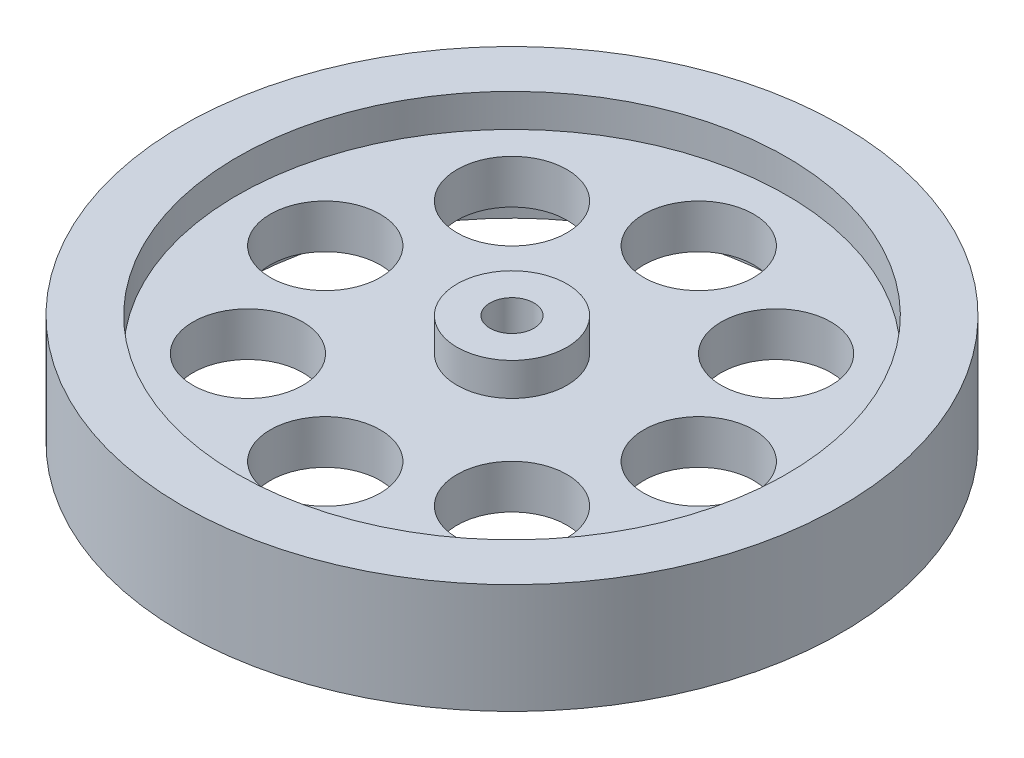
ISO-10303-21;
HEADER;
FILE_DESCRIPTION(('STEP AP214'),'2;1');
FILE_NAME('part.step','',(''),(''),'','','');
FILE_SCHEMA(('AUTOMOTIVE_DESIGN { 1 0 10303 214 1 1 1 1 }'));
ENDSEC;
DATA;
#1=APPLICATION_CONTEXT('core data for automotive mechanical design processes');
#2=APPLICATION_PROTOCOL_DEFINITION('international standard','automotive_design',2000,#1);
#3=PRODUCT_CONTEXT('',#1,'mechanical');
#4=PRODUCT('Part','Part','',(#3));
#5=PRODUCT_RELATED_PRODUCT_CATEGORY('part','',(#4));
#6=PRODUCT_DEFINITION_FORMATION('','',#4);
#7=PRODUCT_DEFINITION_CONTEXT('part definition',#1,'design');
#8=PRODUCT_DEFINITION('design','',#6,#7);
#9=PRODUCT_DEFINITION_SHAPE('','',#8);
#10=(LENGTH_UNIT() NAMED_UNIT(*) SI_UNIT(.MILLI.,.METRE.));
#11=(NAMED_UNIT(*) PLANE_ANGLE_UNIT() SI_UNIT($,.RADIAN.));
#12=(NAMED_UNIT(*) SI_UNIT($,.STERADIAN.) SOLID_ANGLE_UNIT());
#13=UNCERTAINTY_MEASURE_WITH_UNIT(LENGTH_MEASURE(1.E-05),#10,'distance_accuracy_value','');
#14=(GEOMETRIC_REPRESENTATION_CONTEXT(3) GLOBAL_UNCERTAINTY_ASSIGNED_CONTEXT((#13)) GLOBAL_UNIT_ASSIGNED_CONTEXT((#10,
#11,#12)) REPRESENTATION_CONTEXT('',''));
#15=CARTESIAN_POINT('',(0.,0.,0.));
#16=DIRECTION('',(0.,0.,1.));
#17=DIRECTION('',(1.,0.,0.));
#18=AXIS2_PLACEMENT_3D('',#15,#16,#17);
#19=CARTESIAN_POINT('',(0.,0.,0.));
#20=DIRECTION('',(0.,1.,0.));
#21=DIRECTION('',(0.,0.,1.));
#22=AXIS2_PLACEMENT_3D('',#19,#20,#21);
#23=CYLINDRICAL_SURFACE('',#22,5.);
#24=CARTESIAN_POINT('',(0.,0.,0.));
#25=DIRECTION('',(0.,1.,0.));
#26=DIRECTION('',(0.,0.,1.));
#27=AXIS2_PLACEMENT_3D('',#24,#25,#26);
#28=CIRCLE('',#27,5.);
#29=CARTESIAN_POINT('',(0.,0.,5.));
#30=VERTEX_POINT('',#29);
#31=EDGE_CURVE('E10',#30,#30,#28,.T.);
#32=ORIENTED_EDGE('',*,*,#31,.T.);
#33=EDGE_LOOP('',(#32));
#34=FACE_BOUND('',#33,.T.);
#35=CARTESIAN_POINT('',(0.,3.,0.));
#36=DIRECTION('',(0.,1.,0.));
#37=DIRECTION('',(0.,0.,1.));
#38=AXIS2_PLACEMENT_3D('',#35,#36,#37);
#39=CIRCLE('',#38,5.);
#40=CARTESIAN_POINT('',(0.,3.,5.));
#41=VERTEX_POINT('',#40);
#42=EDGE_CURVE('E82',#41,#41,#39,.T.);
#43=ORIENTED_EDGE('',*,*,#42,.F.);
#44=EDGE_LOOP('',(#43));
#45=FACE_BOUND('',#44,.T.);
#46=ADVANCED_FACE('F33',(#34,#45),#23,.T.);
#47=CARTESIAN_POINT('',(-5.,0.,0.));
#48=DIRECTION('',(0.,-1.,0.));
#49=DIRECTION('',(0.,0.,-1.));
#50=AXIS2_PLACEMENT_3D('',#47,#48,#49);
#51=PLANE('',#50);
#52=CARTESIAN_POINT('',(0.,0.,0.));
#53=DIRECTION('',(0.,1.,0.));
#54=DIRECTION('',(0.,0.,1.));
#55=AXIS2_PLACEMENT_3D('',#52,#53,#54);
#56=CIRCLE('',#55,3.00000000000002);
#57=CARTESIAN_POINT('',(0.,0.,3.00000000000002));
#58=VERTEX_POINT('',#57);
#59=EDGE_CURVE('E39',#58,#58,#56,.T.);
#60=ORIENTED_EDGE('',*,*,#59,.T.);
#61=EDGE_LOOP('',(#60));
#62=FACE_BOUND('',#61,.T.);
#63=ORIENTED_EDGE('',*,*,#31,.F.);
#64=EDGE_LOOP('',(#63));
#65=FACE_BOUND('',#64,.T.);
#66=ADVANCED_FACE('F218',(#62,#65),#51,.T.);
#67=CARTESIAN_POINT('',(0.,0.,0.));
#68=DIRECTION('',(0.,-1.,0.));
#69=DIRECTION('',(0.,0.,-1.));
#70=AXIS2_PLACEMENT_3D('',#67,#68,#69);
#71=CONICAL_SURFACE('',#70,3.00000000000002,0.78539816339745);
#72=CARTESIAN_POINT('',(0.,1.50000000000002,0.));
#73=DIRECTION('',(0.,1.,0.));
#74=DIRECTION('',(0.,0.,1.));
#75=AXIS2_PLACEMENT_3D('',#72,#73,#74);
#76=CIRCLE('',#75,1.5);
#77=CARTESIAN_POINT('',(0.,1.50000000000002,1.5));
#78=VERTEX_POINT('',#77);
#79=EDGE_CURVE('E43',#78,#78,#76,.T.);
#80=ORIENTED_EDGE('',*,*,#79,.T.);
#81=EDGE_LOOP('',(#80));
#82=FACE_BOUND('',#81,.T.);
#83=ORIENTED_EDGE('',*,*,#59,.F.);
#84=EDGE_LOOP('',(#83));
#85=FACE_BOUND('',#84,.T.);
#86=ADVANCED_FACE('F212',(#82,#85),#71,.F.);
#87=CARTESIAN_POINT('',(0.,0.,0.));
#88=DIRECTION('',(0.,1.,0.));
#89=DIRECTION('',(0.,0.,1.));
#90=AXIS2_PLACEMENT_3D('',#87,#88,#89);
#91=CYLINDRICAL_SURFACE('',#90,1.5);
#92=CARTESIAN_POINT('',(0.,4.00000000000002,0.));
#93=DIRECTION('',(0.,1.,0.));
#94=DIRECTION('',(0.,0.,1.));
#95=AXIS2_PLACEMENT_3D('',#92,#93,#94);
#96=CIRCLE('',#95,1.5);
#97=CARTESIAN_POINT('',(0.,4.00000000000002,1.5));
#98=VERTEX_POINT('',#97);
#99=EDGE_CURVE('E47',#98,#98,#96,.T.);
#100=ORIENTED_EDGE('',*,*,#99,.T.);
#101=EDGE_LOOP('',(#100));
#102=FACE_BOUND('',#101,.T.);
#103=ORIENTED_EDGE('',*,*,#79,.F.);
#104=EDGE_LOOP('',(#103));
#105=FACE_BOUND('',#104,.T.);
#106=ADVANCED_FACE('F206',(#102,#105),#91,.F.);
#107=CARTESIAN_POINT('',(-2.,4.00000000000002,0.));
#108=DIRECTION('',(0.,1.,0.));
#109=DIRECTION('',(0.,0.,1.));
#110=AXIS2_PLACEMENT_3D('',#107,#108,#109);
#111=PLANE('',#110);
#112=CARTESIAN_POINT('',(0.,4.00000000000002,0.));
#113=DIRECTION('',(0.,1.,0.));
#114=DIRECTION('',(0.,0.,1.));
#115=AXIS2_PLACEMENT_3D('',#112,#113,#114);
#116=CIRCLE('',#115,2.);
#117=CARTESIAN_POINT('',(0.,4.00000000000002,2.));
#118=VERTEX_POINT('',#117);
#119=EDGE_CURVE('E52',#118,#118,#116,.T.);
#120=ORIENTED_EDGE('',*,*,#119,.T.);
#121=EDGE_LOOP('',(#120));
#122=FACE_BOUND('',#121,.T.);
#123=ORIENTED_EDGE('',*,*,#99,.F.);
#124=EDGE_LOOP('',(#123));
#125=FACE_BOUND('',#124,.T.);
#126=ADVANCED_FACE('F200',(#122,#125),#111,.T.);
#127=CARTESIAN_POINT('',(0.,0.,0.));
#128=DIRECTION('',(0.,1.,0.));
#129=DIRECTION('',(0.,0.,1.));
#130=AXIS2_PLACEMENT_3D('',#127,#128,#129);
#131=CYLINDRICAL_SURFACE('',#130,2.);
#132=CARTESIAN_POINT('',(0.,10.,0.));
#133=DIRECTION('',(0.,1.,0.));
#134=DIRECTION('',(0.,0.,1.));
#135=AXIS2_PLACEMENT_3D('',#132,#133,#134);
#136=CIRCLE('',#135,2.);
#137=CARTESIAN_POINT('',(0.,10.,2.));
#138=VERTEX_POINT('',#137);
#139=EDGE_CURVE('E55',#138,#138,#136,.T.);
#140=ORIENTED_EDGE('',*,*,#139,.T.);
#141=EDGE_LOOP('',(#140));
#142=FACE_BOUND('',#141,.T.);
#143=ORIENTED_EDGE('',*,*,#119,.F.);
#144=EDGE_LOOP('',(#143));
#145=FACE_BOUND('',#144,.T.);
#146=ADVANCED_FACE('F194',(#142,#145),#131,.F.);
#147=CARTESIAN_POINT('',(-2.,10.,0.));
#148=DIRECTION('',(0.,1.,0.));
#149=DIRECTION('',(0.,0.,1.));
#150=AXIS2_PLACEMENT_3D('',#147,#148,#149);
#151=PLANE('',#150);
#152=CARTESIAN_POINT('',(0.,10.,0.));
#153=DIRECTION('',(0.,1.,0.));
#154=DIRECTION('',(0.,0.,1.));
#155=AXIS2_PLACEMENT_3D('',#152,#153,#154);
#156=CIRCLE('',#155,5.);
#157=CARTESIAN_POINT('',(0.,10.,5.));
#158=VERTEX_POINT('',#157);
#159=EDGE_CURVE('E58',#158,#158,#156,.T.);
#160=ORIENTED_EDGE('',*,*,#159,.T.);
#161=EDGE_LOOP('',(#160));
#162=FACE_BOUND('',#161,.T.);
#163=ORIENTED_EDGE('',*,*,#139,.F.);
#164=EDGE_LOOP('',(#163));
#165=FACE_BOUND('',#164,.T.);
#166=ADVANCED_FACE('F188',(#162,#165),#151,.T.);
#167=CARTESIAN_POINT('',(0.,0.,0.));
#168=DIRECTION('',(0.,1.,0.));
#169=DIRECTION('',(0.,0.,1.));
#170=AXIS2_PLACEMENT_3D('',#167,#168,#169);
#171=CYLINDRICAL_SURFACE('',#170,5.);
#172=CARTESIAN_POINT('',(0.,7.,0.));
#173=DIRECTION('',(0.,1.,0.));
#174=DIRECTION('',(0.,0.,1.));
#175=AXIS2_PLACEMENT_3D('',#172,#173,#174);
#176=CIRCLE('',#175,5.);
#177=CARTESIAN_POINT('',(0.,7.,5.));
#178=VERTEX_POINT('',#177);
#179=EDGE_CURVE('E61',#178,#178,#176,.T.);
#180=ORIENTED_EDGE('',*,*,#179,.T.);
#181=EDGE_LOOP('',(#180));
#182=FACE_BOUND('',#181,.T.);
#183=ORIENTED_EDGE('',*,*,#159,.F.);
#184=EDGE_LOOP('',(#183));
#185=FACE_BOUND('',#184,.T.);
#186=ADVANCED_FACE('F181',(#182,#185),#171,.T.);
#187=CARTESIAN_POINT('',(-5.,7.,0.));
#188=DIRECTION('',(0.,1.,0.));
#189=DIRECTION('',(0.,0.,1.));
#190=AXIS2_PLACEMENT_3D('',#187,#188,#189);
#191=PLANE('',#190);
#192=CARTESIAN_POINT('',(-12.0208152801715,7.,-12.0208152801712));
#193=DIRECTION('',(0.,1.,0.));
#194=DIRECTION('',(0.,0.,1.));
#195=AXIS2_PLACEMENT_3D('',#192,#193,#194);
#196=CIRCLE('',#195,5.);
#197=CARTESIAN_POINT('',(-12.0208152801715,7.,-7.02081528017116));
#198=VERTEX_POINT('',#197);
#199=EDGE_CURVE('E85',#198,#198,#196,.T.);
#200=ORIENTED_EDGE('',*,*,#199,.F.);
#201=EDGE_LOOP('',(#200));
#202=FACE_BOUND('',#201,.T.);
#203=CARTESIAN_POINT('',(-1.78065548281E-13,7.,-17.));
#204=DIRECTION('',(0.,1.,0.));
#205=DIRECTION('',(0.,0.,1.));
#206=AXIS2_PLACEMENT_3D('',#203,#204,#205);
#207=CIRCLE('',#206,5.);
#208=CARTESIAN_POINT('',(-1.78065548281E-13,7.,-12.));
#209=VERTEX_POINT('',#208);
#210=EDGE_CURVE('E88',#209,#209,#207,.T.);
#211=ORIENTED_EDGE('',*,*,#210,.F.);
#212=EDGE_LOOP('',(#211));
#213=FACE_BOUND('',#212,.T.);
#214=CARTESIAN_POINT('',(12.0208152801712,7.,-12.0208152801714));
#215=DIRECTION('',(0.,1.,0.));
#216=DIRECTION('',(0.,0.,1.));
#217=AXIS2_PLACEMENT_3D('',#214,#215,#216);
#218=CIRCLE('',#217,5.);
#219=CARTESIAN_POINT('',(12.0208152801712,7.,-7.02081528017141));
#220=VERTEX_POINT('',#219);
#221=EDGE_CURVE('E91',#220,#220,#218,.T.);
#222=ORIENTED_EDGE('',*,*,#221,.F.);
#223=EDGE_LOOP('',(#222));
#224=FACE_BOUND('',#223,.T.);
#225=CARTESIAN_POINT('',(17.,7.,-1.18710365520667E-13));
#226=DIRECTION('',(0.,1.,0.));
#227=DIRECTION('',(0.,0.,1.));
#228=AXIS2_PLACEMENT_3D('',#225,#226,#227);
#229=CIRCLE('',#228,5.);
#230=CARTESIAN_POINT('',(17.,7.,4.99999999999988));
#231=VERTEX_POINT('',#230);
#232=EDGE_CURVE('E94',#231,#231,#229,.T.);
#233=ORIENTED_EDGE('',*,*,#232,.F.);
#234=EDGE_LOOP('',(#233));
#235=FACE_BOUND('',#234,.T.);
#236=CARTESIAN_POINT('',(12.0208152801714,7.,12.0208152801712));
#237=DIRECTION('',(0.,1.,0.));
#238=DIRECTION('',(0.,0.,1.));
#239=AXIS2_PLACEMENT_3D('',#236,#237,#238);
#240=CIRCLE('',#239,5.);
#241=CARTESIAN_POINT('',(12.0208152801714,7.,17.0208152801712));
#242=VERTEX_POINT('',#241);
#243=EDGE_CURVE('E97',#242,#242,#240,.T.);
#244=ORIENTED_EDGE('',*,*,#243,.F.);
#245=EDGE_LOOP('',(#244));
#246=FACE_BOUND('',#245,.T.);
#247=CARTESIAN_POINT('',(0.,7.,17.));
#248=DIRECTION('',(0.,1.,0.));
#249=DIRECTION('',(0.,0.,1.));
#250=AXIS2_PLACEMENT_3D('',#247,#248,#249);
#251=CIRCLE('',#250,5.);
#252=CARTESIAN_POINT('',(0.,7.,22.));
#253=VERTEX_POINT('',#252);
#254=EDGE_CURVE('E100',#253,#253,#251,.T.);
#255=ORIENTED_EDGE('',*,*,#254,.F.);
#256=EDGE_LOOP('',(#255));
#257=FACE_BOUND('',#256,.T.);
#258=CARTESIAN_POINT('',(-12.0208152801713,7.,12.0208152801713));
#259=DIRECTION('',(0.,1.,0.));
#260=DIRECTION('',(0.,0.,1.));
#261=AXIS2_PLACEMENT_3D('',#258,#259,#260);
#262=CIRCLE('',#261,5.);
#263=CARTESIAN_POINT('',(-12.0208152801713,7.,17.0208152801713));
#264=VERTEX_POINT('',#263);
#265=EDGE_CURVE('E103',#264,#264,#262,.T.);
#266=ORIENTED_EDGE('',*,*,#265,.F.);
#267=EDGE_LOOP('',(#266));
#268=FACE_BOUND('',#267,.T.);
#269=CARTESIAN_POINT('',(-17.,7.,0.));
#270=DIRECTION('',(0.,1.,0.));
#271=DIRECTION('',(0.,0.,1.));
#272=AXIS2_PLACEMENT_3D('',#269,#270,#271);
#273=CIRCLE('',#272,5.);
#274=CARTESIAN_POINT('',(-17.,7.,5.));
#275=VERTEX_POINT('',#274);
#276=EDGE_CURVE('E106',#275,#275,#273,.T.);
#277=ORIENTED_EDGE('',*,*,#276,.F.);
#278=EDGE_LOOP('',(#277));
#279=FACE_BOUND('',#278,.T.);
#280=CARTESIAN_POINT('',(0.,7.,0.));
#281=DIRECTION('',(0.,1.,0.));
#282=DIRECTION('',(0.,0.,1.));
#283=AXIS2_PLACEMENT_3D('',#280,#281,#282);
#284=CIRCLE('',#283,25.);
#285=CARTESIAN_POINT('',(0.,7.,25.));
#286=VERTEX_POINT('',#285);
#287=EDGE_CURVE('E64',#286,#286,#284,.T.);
#288=ORIENTED_EDGE('',*,*,#287,.T.);
#289=EDGE_LOOP('',(#288));
#290=FACE_BOUND('',#289,.T.);
#291=ORIENTED_EDGE('',*,*,#179,.F.);
#292=EDGE_LOOP('',(#291));
#293=FACE_BOUND('',#292,.T.);
#294=ADVANCED_FACE('F175',(#202,#213,#224,#235,#246,#257,#268,#279,#290,#293),#191,.T.);
#295=CARTESIAN_POINT('',(0.,0.,0.));
#296=DIRECTION('',(0.,1.,0.));
#297=DIRECTION('',(0.,0.,1.));
#298=AXIS2_PLACEMENT_3D('',#295,#296,#297);
#299=CYLINDRICAL_SURFACE('',#298,25.);
#300=CARTESIAN_POINT('',(0.,10.,0.));
#301=DIRECTION('',(0.,1.,0.));
#302=DIRECTION('',(0.,0.,1.));
#303=AXIS2_PLACEMENT_3D('',#300,#301,#302);
#304=CIRCLE('',#303,25.);
#305=CARTESIAN_POINT('',(0.,10.,25.));
#306=VERTEX_POINT('',#305);
#307=EDGE_CURVE('E67',#306,#306,#304,.T.);
#308=ORIENTED_EDGE('',*,*,#307,.T.);
#309=EDGE_LOOP('',(#308));
#310=FACE_BOUND('',#309,.T.);
#311=ORIENTED_EDGE('',*,*,#287,.F.);
#312=EDGE_LOOP('',(#311));
#313=FACE_BOUND('',#312,.T.);
#314=ADVANCED_FACE('F169',(#310,#313),#299,.F.);
#315=CARTESIAN_POINT('',(-25.,10.,0.));
#316=DIRECTION('',(0.,1.,0.));
#317=DIRECTION('',(0.,0.,1.));
#318=AXIS2_PLACEMENT_3D('',#315,#316,#317);
#319=PLANE('',#318);
#320=CARTESIAN_POINT('',(0.,10.,0.));
#321=DIRECTION('',(0.,1.,0.));
#322=DIRECTION('',(0.,0.,1.));
#323=AXIS2_PLACEMENT_3D('',#320,#321,#322);
#324=CIRCLE('',#323,30.);
#325=CARTESIAN_POINT('',(0.,10.,30.));
#326=VERTEX_POINT('',#325);
#327=EDGE_CURVE('E70',#326,#326,#324,.T.);
#328=ORIENTED_EDGE('',*,*,#327,.T.);
#329=EDGE_LOOP('',(#328));
#330=FACE_BOUND('',#329,.T.);
#331=ORIENTED_EDGE('',*,*,#307,.F.);
#332=EDGE_LOOP('',(#331));
#333=FACE_BOUND('',#332,.T.);
#334=ADVANCED_FACE('F163',(#330,#333),#319,.T.);
#335=CARTESIAN_POINT('',(0.,0.,0.));
#336=DIRECTION('',(0.,1.,0.));
#337=DIRECTION('',(0.,0.,1.));
#338=AXIS2_PLACEMENT_3D('',#335,#336,#337);
#339=CYLINDRICAL_SURFACE('',#338,30.);
#340=CARTESIAN_POINT('',(0.,0.,0.));
#341=DIRECTION('',(0.,1.,0.));
#342=DIRECTION('',(0.,0.,1.));
#343=AXIS2_PLACEMENT_3D('',#340,#341,#342);
#344=CIRCLE('',#343,30.);
#345=CARTESIAN_POINT('',(0.,0.,30.));
#346=VERTEX_POINT('',#345);
#347=EDGE_CURVE('E73',#346,#346,#344,.T.);
#348=ORIENTED_EDGE('',*,*,#347,.T.);
#349=EDGE_LOOP('',(#348));
#350=FACE_BOUND('',#349,.T.);
#351=ORIENTED_EDGE('',*,*,#327,.F.);
#352=EDGE_LOOP('',(#351));
#353=FACE_BOUND('',#352,.T.);
#354=ADVANCED_FACE('F157',(#350,#353),#339,.T.);
#355=CARTESIAN_POINT('',(-30.,0.,0.));
#356=DIRECTION('',(0.,-1.,0.));
#357=DIRECTION('',(0.,0.,-1.));
#358=AXIS2_PLACEMENT_3D('',#355,#356,#357);
#359=PLANE('',#358);
#360=CARTESIAN_POINT('',(0.,0.,0.));
#361=DIRECTION('',(0.,1.,0.));
#362=DIRECTION('',(0.,0.,1.));
#363=AXIS2_PLACEMENT_3D('',#360,#361,#362);
#364=CIRCLE('',#363,25.);
#365=CARTESIAN_POINT('',(0.,0.,25.));
#366=VERTEX_POINT('',#365);
#367=EDGE_CURVE('E76',#366,#366,#364,.T.);
#368=ORIENTED_EDGE('',*,*,#367,.T.);
#369=EDGE_LOOP('',(#368));
#370=FACE_BOUND('',#369,.T.);
#371=ORIENTED_EDGE('',*,*,#347,.F.);
#372=EDGE_LOOP('',(#371));
#373=FACE_BOUND('',#372,.T.);
#374=ADVANCED_FACE('F151',(#370,#373),#359,.T.);
#375=CARTESIAN_POINT('',(0.,0.,0.));
#376=DIRECTION('',(0.,1.,0.));
#377=DIRECTION('',(0.,0.,1.));
#378=AXIS2_PLACEMENT_3D('',#375,#376,#377);
#379=CYLINDRICAL_SURFACE('',#378,25.);
#380=CARTESIAN_POINT('',(0.,3.,0.));
#381=DIRECTION('',(0.,1.,0.));
#382=DIRECTION('',(0.,0.,1.));
#383=AXIS2_PLACEMENT_3D('',#380,#381,#382);
#384=CIRCLE('',#383,25.);
#385=CARTESIAN_POINT('',(0.,3.,25.));
#386=VERTEX_POINT('',#385);
#387=EDGE_CURVE('E79',#386,#386,#384,.T.);
#388=ORIENTED_EDGE('',*,*,#387,.T.);
#389=EDGE_LOOP('',(#388));
#390=FACE_BOUND('',#389,.T.);
#391=ORIENTED_EDGE('',*,*,#367,.F.);
#392=EDGE_LOOP('',(#391));
#393=FACE_BOUND('',#392,.T.);
#394=ADVANCED_FACE('F140',(#390,#393),#379,.F.);
#395=CARTESIAN_POINT('',(-25.,3.,0.));
#396=DIRECTION('',(0.,-1.,0.));
#397=DIRECTION('',(0.,0.,-1.));
#398=AXIS2_PLACEMENT_3D('',#395,#396,#397);
#399=PLANE('',#398);
#400=CARTESIAN_POINT('',(-12.0208152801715,3.,-12.0208152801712));
#401=DIRECTION('',(0.,-1.,0.));
#402=DIRECTION('',(0.,0.,-1.));
#403=AXIS2_PLACEMENT_3D('',#400,#401,#402);
#404=CIRCLE('',#403,5.);
#405=CARTESIAN_POINT('',(-12.0208152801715,3.,-17.0208152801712));
#406=VERTEX_POINT('',#405);
#407=EDGE_CURVE('E113',#406,#406,#404,.T.);
#408=ORIENTED_EDGE('',*,*,#407,.F.);
#409=EDGE_LOOP('',(#408));
#410=FACE_BOUND('',#409,.T.);
#411=CARTESIAN_POINT('',(-1.78065548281E-13,3.,-17.));
#412=DIRECTION('',(0.,-1.,0.));
#413=DIRECTION('',(0.,0.,-1.));
#414=AXIS2_PLACEMENT_3D('',#411,#412,#413);
#415=CIRCLE('',#414,5.);
#416=CARTESIAN_POINT('',(-1.78065548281E-13,3.,-22.));
#417=VERTEX_POINT('',#416);
#418=EDGE_CURVE('E116',#417,#417,#415,.T.);
#419=ORIENTED_EDGE('',*,*,#418,.F.);
#420=EDGE_LOOP('',(#419));
#421=FACE_BOUND('',#420,.T.);
#422=CARTESIAN_POINT('',(12.0208152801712,3.,-12.0208152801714));
#423=DIRECTION('',(0.,-1.,0.));
#424=DIRECTION('',(0.,0.,-1.));
#425=AXIS2_PLACEMENT_3D('',#422,#423,#424);
#426=CIRCLE('',#425,5.);
#427=CARTESIAN_POINT('',(12.0208152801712,3.,-17.0208152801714));
#428=VERTEX_POINT('',#427);
#429=EDGE_CURVE('E119',#428,#428,#426,.T.);
#430=ORIENTED_EDGE('',*,*,#429,.F.);
#431=EDGE_LOOP('',(#430));
#432=FACE_BOUND('',#431,.T.);
#433=CARTESIAN_POINT('',(17.,3.,-1.18710365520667E-13));
#434=DIRECTION('',(0.,-1.,0.));
#435=DIRECTION('',(0.,0.,-1.));
#436=AXIS2_PLACEMENT_3D('',#433,#434,#435);
#437=CIRCLE('',#436,5.);
#438=CARTESIAN_POINT('',(17.,3.,-5.00000000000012));
#439=VERTEX_POINT('',#438);
#440=EDGE_CURVE('E122',#439,#439,#437,.T.);
#441=ORIENTED_EDGE('',*,*,#440,.F.);
#442=EDGE_LOOP('',(#441));
#443=FACE_BOUND('',#442,.T.);
#444=CARTESIAN_POINT('',(12.0208152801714,3.,12.0208152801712));
#445=DIRECTION('',(0.,-1.,0.));
#446=DIRECTION('',(0.,0.,-1.));
#447=AXIS2_PLACEMENT_3D('',#444,#445,#446);
#448=CIRCLE('',#447,5.);
#449=CARTESIAN_POINT('',(12.0208152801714,3.,7.02081528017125));
#450=VERTEX_POINT('',#449);
#451=EDGE_CURVE('E125',#450,#450,#448,.T.);
#452=ORIENTED_EDGE('',*,*,#451,.F.);
#453=EDGE_LOOP('',(#452));
#454=FACE_BOUND('',#453,.T.);
#455=CARTESIAN_POINT('',(0.,3.,17.));
#456=DIRECTION('',(0.,-1.,0.));
#457=DIRECTION('',(0.,0.,-1.));
#458=AXIS2_PLACEMENT_3D('',#455,#456,#457);
#459=CIRCLE('',#458,5.);
#460=CARTESIAN_POINT('',(0.,3.,12.));
#461=VERTEX_POINT('',#460);
#462=EDGE_CURVE('E128',#461,#461,#459,.T.);
#463=ORIENTED_EDGE('',*,*,#462,.F.);
#464=EDGE_LOOP('',(#463));
#465=FACE_BOUND('',#464,.T.);
#466=CARTESIAN_POINT('',(-12.0208152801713,3.,12.0208152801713));
#467=DIRECTION('',(0.,-1.,0.));
#468=DIRECTION('',(0.,0.,-1.));
#469=AXIS2_PLACEMENT_3D('',#466,#467,#468);
#470=CIRCLE('',#469,5.);
#471=CARTESIAN_POINT('',(-12.0208152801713,3.,7.02081528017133));
#472=VERTEX_POINT('',#471);
#473=EDGE_CURVE('E112',#472,#472,#470,.T.);
#474=ORIENTED_EDGE('',*,*,#473,.F.);
#475=EDGE_LOOP('',(#474));
#476=FACE_BOUND('',#475,.T.);
#477=CARTESIAN_POINT('',(-17.,3.,0.));
#478=DIRECTION('',(0.,-1.,0.));
#479=DIRECTION('',(0.,0.,-1.));
#480=AXIS2_PLACEMENT_3D('',#477,#478,#479);
#481=CIRCLE('',#480,5.);
#482=CARTESIAN_POINT('',(-17.,3.,-5.));
#483=VERTEX_POINT('',#482);
#484=EDGE_CURVE('E109',#483,#483,#481,.T.);
#485=ORIENTED_EDGE('',*,*,#484,.F.);
#486=EDGE_LOOP('',(#485));
#487=FACE_BOUND('',#486,.T.);
#488=ORIENTED_EDGE('',*,*,#42,.T.);
#489=EDGE_LOOP('',(#488));
#490=FACE_BOUND('',#489,.T.);
#491=ORIENTED_EDGE('',*,*,#387,.F.);
#492=EDGE_LOOP('',(#491));
#493=FACE_BOUND('',#492,.T.);
#494=ADVANCED_FACE('F136',(#410,#421,#432,#443,#454,#465,#476,#487,#490,#493),#399,.T.);
#495=CARTESIAN_POINT('',(-17.,10.,0.));
#496=DIRECTION('',(0.,-1.,0.));
#497=DIRECTION('',(0.,0.,-1.));
#498=AXIS2_PLACEMENT_3D('',#495,#496,#497);
#499=CYLINDRICAL_SURFACE('',#498,5.);
#500=ORIENTED_EDGE('',*,*,#276,.T.);
#501=EDGE_LOOP('',(#500));
#502=FACE_BOUND('',#501,.T.);
#503=ORIENTED_EDGE('',*,*,#484,.T.);
#504=EDGE_LOOP('',(#503));
#505=FACE_BOUND('',#504,.T.);
#506=ADVANCED_FACE('F139',(#502,#505),#499,.F.);
#507=CARTESIAN_POINT('',(-12.0208152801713,10.,12.0208152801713));
#508=DIRECTION('',(0.,-1.,0.));
#509=DIRECTION('',(0.,0.,-1.));
#510=AXIS2_PLACEMENT_3D('',#507,#508,#509);
#511=CYLINDRICAL_SURFACE('',#510,5.);
#512=ORIENTED_EDGE('',*,*,#265,.T.);
#513=EDGE_LOOP('',(#512));
#514=FACE_BOUND('',#513,.T.);
#515=ORIENTED_EDGE('',*,*,#473,.T.);
#516=EDGE_LOOP('',(#515));
#517=FACE_BOUND('',#516,.T.);
#518=ADVANCED_FACE('F134',(#514,#517),#511,.F.);
#519=CARTESIAN_POINT('',(0.,10.,17.));
#520=DIRECTION('',(0.,-1.,0.));
#521=DIRECTION('',(0.,0.,-1.));
#522=AXIS2_PLACEMENT_3D('',#519,#520,#521);
#523=CYLINDRICAL_SURFACE('',#522,5.);
#524=ORIENTED_EDGE('',*,*,#254,.T.);
#525=EDGE_LOOP('',(#524));
#526=FACE_BOUND('',#525,.T.);
#527=ORIENTED_EDGE('',*,*,#462,.T.);
#528=EDGE_LOOP('',(#527));
#529=FACE_BOUND('',#528,.T.);
#530=ADVANCED_FACE('F304',(#526,#529),#523,.F.);
#531=CARTESIAN_POINT('',(12.0208152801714,10.,12.0208152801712));
#532=DIRECTION('',(0.,-1.,0.));
#533=DIRECTION('',(0.,0.,-1.));
#534=AXIS2_PLACEMENT_3D('',#531,#532,#533);
#535=CYLINDRICAL_SURFACE('',#534,5.);
#536=ORIENTED_EDGE('',*,*,#243,.T.);
#537=EDGE_LOOP('',(#536));
#538=FACE_BOUND('',#537,.T.);
#539=ORIENTED_EDGE('',*,*,#451,.T.);
#540=EDGE_LOOP('',(#539));
#541=FACE_BOUND('',#540,.T.);
#542=ADVANCED_FACE('F313',(#538,#541),#535,.F.);
#543=CARTESIAN_POINT('',(17.,10.,-1.18710365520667E-13));
#544=DIRECTION('',(0.,-1.,0.));
#545=DIRECTION('',(0.,0.,-1.));
#546=AXIS2_PLACEMENT_3D('',#543,#544,#545);
#547=CYLINDRICAL_SURFACE('',#546,5.);
#548=ORIENTED_EDGE('',*,*,#232,.T.);
#549=EDGE_LOOP('',(#548));
#550=FACE_BOUND('',#549,.T.);
#551=ORIENTED_EDGE('',*,*,#440,.T.);
#552=EDGE_LOOP('',(#551));
#553=FACE_BOUND('',#552,.T.);
#554=ADVANCED_FACE('F322',(#550,#553),#547,.F.);
#555=CARTESIAN_POINT('',(12.0208152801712,10.,-12.0208152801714));
#556=DIRECTION('',(0.,-1.,0.));
#557=DIRECTION('',(0.,0.,-1.));
#558=AXIS2_PLACEMENT_3D('',#555,#556,#557);
#559=CYLINDRICAL_SURFACE('',#558,5.);
#560=ORIENTED_EDGE('',*,*,#221,.T.);
#561=EDGE_LOOP('',(#560));
#562=FACE_BOUND('',#561,.T.);
#563=ORIENTED_EDGE('',*,*,#429,.T.);
#564=EDGE_LOOP('',(#563));
#565=FACE_BOUND('',#564,.T.);
#566=ADVANCED_FACE('F331',(#562,#565),#559,.F.);
#567=CARTESIAN_POINT('',(-1.78065548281E-13,10.,-17.));
#568=DIRECTION('',(0.,-1.,0.));
#569=DIRECTION('',(0.,0.,-1.));
#570=AXIS2_PLACEMENT_3D('',#567,#568,#569);
#571=CYLINDRICAL_SURFACE('',#570,5.);
#572=ORIENTED_EDGE('',*,*,#210,.T.);
#573=EDGE_LOOP('',(#572));
#574=FACE_BOUND('',#573,.T.);
#575=ORIENTED_EDGE('',*,*,#418,.T.);
#576=EDGE_LOOP('',(#575));
#577=FACE_BOUND('',#576,.T.);
#578=ADVANCED_FACE('F340',(#574,#577),#571,.F.);
#579=CARTESIAN_POINT('',(-12.0208152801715,10.,-12.0208152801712));
#580=DIRECTION('',(0.,-1.,0.));
#581=DIRECTION('',(0.,0.,-1.));
#582=AXIS2_PLACEMENT_3D('',#579,#580,#581);
#583=CYLINDRICAL_SURFACE('',#582,5.);
#584=ORIENTED_EDGE('',*,*,#199,.T.);
#585=EDGE_LOOP('',(#584));
#586=FACE_BOUND('',#585,.T.);
#587=ORIENTED_EDGE('',*,*,#407,.T.);
#588=EDGE_LOOP('',(#587));
#589=FACE_BOUND('',#588,.T.);
#590=ADVANCED_FACE('F349',(#586,#589),#583,.F.);
#591=CLOSED_SHELL('',(#46,#66,#86,#106,#126,#146,#166,#186,#294,#314,#334,#354,#374,#394,#494,
#506,#518,#530,#542,#554,#566,#578,#590));
#592=MANIFOLD_SOLID_BREP('B2',#591);
#593=ADVANCED_BREP_SHAPE_REPRESENTATION('',(#18,#592),#14);
#594=SHAPE_DEFINITION_REPRESENTATION(#9,#593);
ENDSEC;
END-ISO-10303-21;
